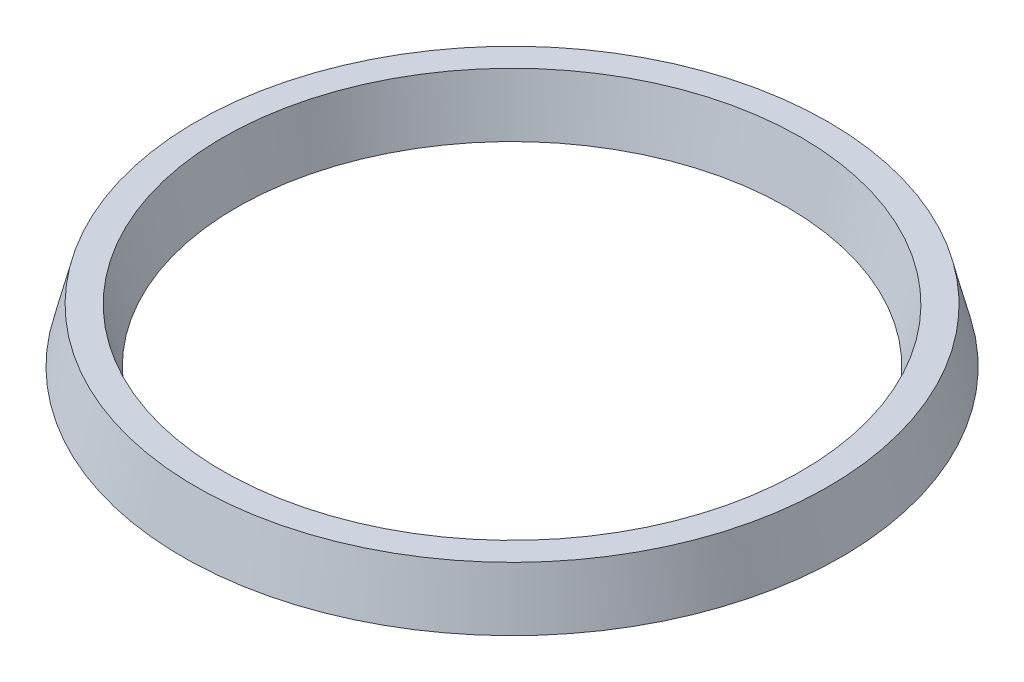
from build123d import *


with BuildPart() as part:
    # Sketch1 → Revolve1 (revolve)
    with BuildSketch(Plane.XY, mode=Mode.PRIVATE) as revolve1_sk:
        with BuildLine():
            Line((-3, 6), (3, 6))
            Line((3, 6), (6, -6))
            Line((6, -6), (3, -6))
            Line((3, -6), (1.863803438, -1.45521375))
            ThreePointArc((1.863803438, -1.45521375), (0, 0), (-1.863803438, -1.45521375))
            Line((-1.863803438, -1.45521375), (-3, -6))
            Line((-3, -6), (-6, -6))
            Line((-6, -6), (-3, 6))
        make_face()
    revolve(revolve1_sk.sketch.rotate(Axis((-67.31, 0, 0), (0, 1, 0)), 90), axis=Axis((-67.31, 0, 0), (0, 1, 0)))


solid = part.part
